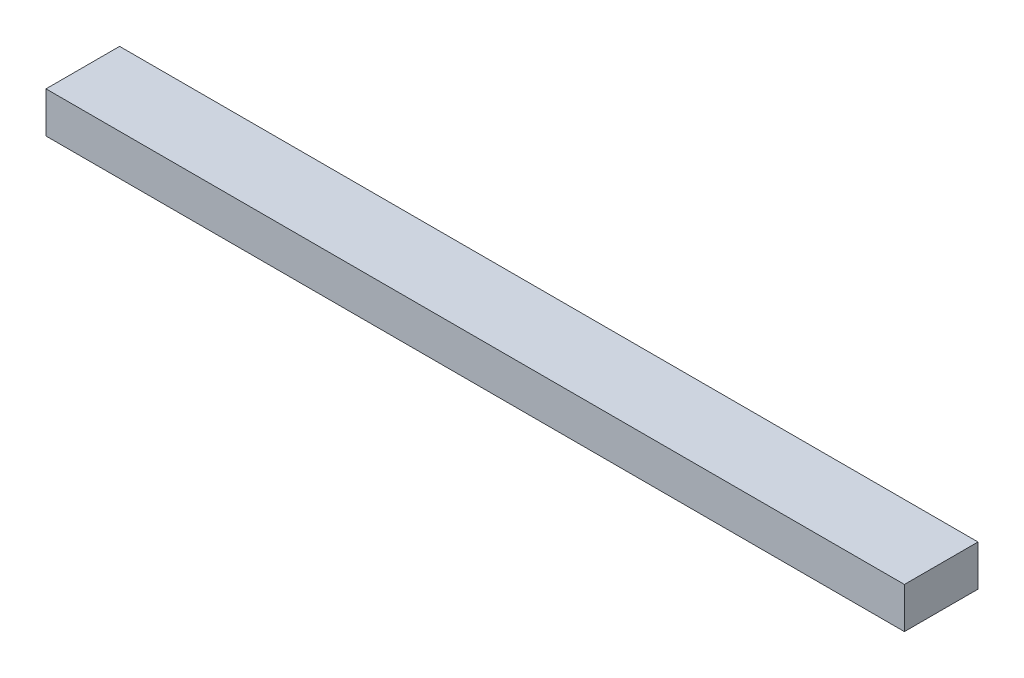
from build123d import *

# Parameters (mm, degrees)
ESQUISSE1_W      = 210
ESQUISSE1_H      = 10
EXTRUSION1_DEPTH = 18


with BuildPart() as part:
    # Esquisse1 → Extrusion1 (new body)
    with BuildSketch(Plane.XY):
        with Locations((105, 5)):
            Rectangle(ESQUISSE1_W, ESQUISSE1_H)
    extrude(amount=-EXTRUSION1_DEPTH)


solid = part.part
